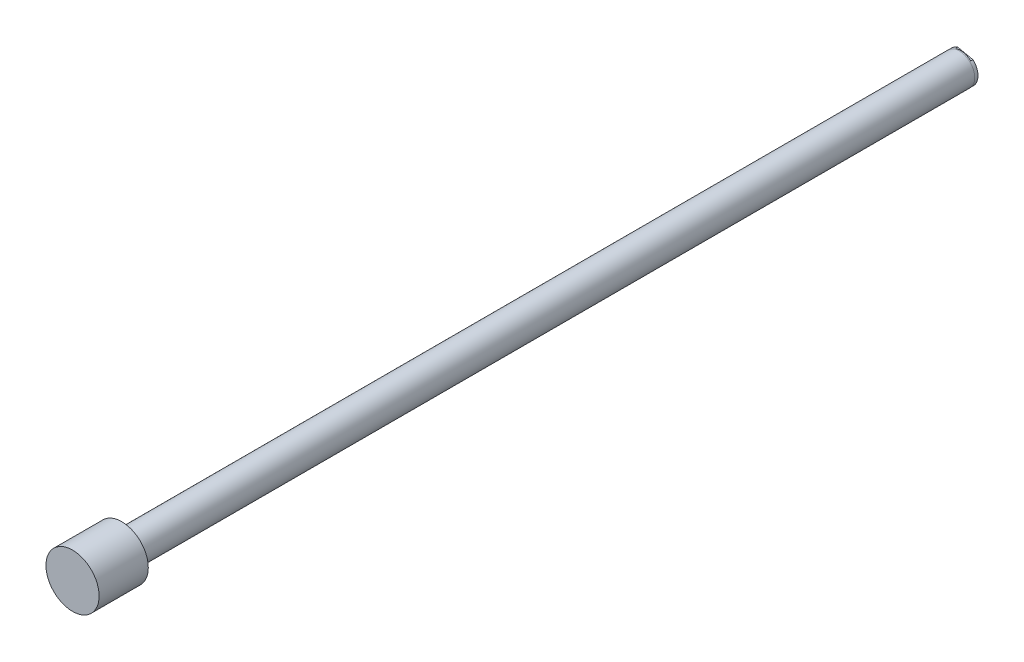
ISO-10303-21;
HEADER;
FILE_DESCRIPTION(('STEP AP214'),'2;1');
FILE_NAME('part.step','',(''),(''),'','','');
FILE_SCHEMA(('AUTOMOTIVE_DESIGN { 1 0 10303 214 1 1 1 1 }'));
ENDSEC;
DATA;
#1=APPLICATION_CONTEXT('core data for automotive mechanical design processes');
#2=APPLICATION_PROTOCOL_DEFINITION('international standard','automotive_design',2000,#1);
#3=PRODUCT_CONTEXT('',#1,'mechanical');
#4=PRODUCT('Part','Part','',(#3));
#5=PRODUCT_RELATED_PRODUCT_CATEGORY('part','',(#4));
#6=PRODUCT_DEFINITION_FORMATION('','',#4);
#7=PRODUCT_DEFINITION_CONTEXT('part definition',#1,'design');
#8=PRODUCT_DEFINITION('design','',#6,#7);
#9=PRODUCT_DEFINITION_SHAPE('','',#8);
#10=(LENGTH_UNIT() NAMED_UNIT(*) SI_UNIT(.MILLI.,.METRE.));
#11=(NAMED_UNIT(*) PLANE_ANGLE_UNIT() SI_UNIT($,.RADIAN.));
#12=(NAMED_UNIT(*) SI_UNIT($,.STERADIAN.) SOLID_ANGLE_UNIT());
#13=UNCERTAINTY_MEASURE_WITH_UNIT(LENGTH_MEASURE(1.E-05),#10,'distance_accuracy_value','');
#14=(GEOMETRIC_REPRESENTATION_CONTEXT(3) GLOBAL_UNCERTAINTY_ASSIGNED_CONTEXT((#13)) GLOBAL_UNIT_ASSIGNED_CONTEXT((#10,
#11,#12)) REPRESENTATION_CONTEXT('',''));
#15=CARTESIAN_POINT('',(0.,0.,0.));
#16=DIRECTION('',(0.,0.,1.));
#17=DIRECTION('',(1.,0.,0.));
#18=AXIS2_PLACEMENT_3D('',#15,#16,#17);
#19=CARTESIAN_POINT('',(0.,0.,35.56));
#20=DIRECTION('',(0.,0.,1.));
#21=DIRECTION('',(1.,0.,0.));
#22=AXIS2_PLACEMENT_3D('',#19,#20,#21);
#23=PLANE('',#22);
#24=CARTESIAN_POINT('',(0.,0.,35.56));
#25=DIRECTION('',(0.,0.,1.));
#26=DIRECTION('',(1.,0.,0.));
#27=AXIS2_PLACEMENT_3D('',#24,#25,#26);
#28=CIRCLE('',#27,38.1);
#29=CARTESIAN_POINT('',(38.1,0.,35.56));
#30=VERTEX_POINT('',#29);
#31=EDGE_CURVE('E109',#30,#30,#28,.T.);
#32=ORIENTED_EDGE('',*,*,#31,.T.);
#33=EDGE_LOOP('',(#32));
#34=FACE_BOUND('',#33,.T.);
#35=ADVANCED_FACE('F16',(#34),#23,.T.);
#36=CARTESIAN_POINT('',(0.,0.,-34.925));
#37=DIRECTION('',(0.,0.,1.));
#38=DIRECTION('',(1.,0.,0.));
#39=AXIS2_PLACEMENT_3D('',#36,#37,#38);
#40=CYLINDRICAL_SURFACE('',#39,38.1);
#41=ORIENTED_EDGE('',*,*,#31,.F.);
#42=EDGE_LOOP('',(#41));
#43=FACE_BOUND('',#42,.T.);
#44=CARTESIAN_POINT('',(0.,0.,-34.92754));
#45=DIRECTION('',(0.,0.,-1.));
#46=DIRECTION('',(-1.,0.,0.));
#47=AXIS2_PLACEMENT_3D('',#44,#45,#46);
#48=CIRCLE('',#47,38.1);
#49=CARTESIAN_POINT('',(-38.1,0.,-34.92754));
#50=VERTEX_POINT('',#49);
#51=EDGE_CURVE('E101',#50,#50,#48,.T.);
#52=ORIENTED_EDGE('',*,*,#51,.F.);
#53=EDGE_LOOP('',(#52));
#54=FACE_BOUND('',#53,.T.);
#55=ADVANCED_FACE('F156',(#43,#54),#40,.T.);
#56=CARTESIAN_POINT('',(0.,0.,-34.92754));
#57=DIRECTION('',(0.,0.,-1.));
#58=DIRECTION('',(-1.,0.,0.));
#59=AXIS2_PLACEMENT_3D('',#56,#57,#58);
#60=PLANE('',#59);
#61=CARTESIAN_POINT('',(0.,0.,-34.92754));
#62=DIRECTION('',(0.,0.,-1.));
#63=DIRECTION('',(-1.,0.,0.));
#64=AXIS2_PLACEMENT_3D('',#61,#62,#63);
#65=CIRCLE('',#64,22.225);
#66=CARTESIAN_POINT('',(-22.225,0.,-34.92754));
#67=VERTEX_POINT('',#66);
#68=EDGE_CURVE('E104',#67,#67,#65,.T.);
#69=ORIENTED_EDGE('',*,*,#68,.F.);
#70=EDGE_LOOP('',(#69));
#71=FACE_BOUND('',#70,.T.);
#72=ORIENTED_EDGE('',*,*,#51,.T.);
#73=EDGE_LOOP('',(#72));
#74=FACE_BOUND('',#73,.T.);
#75=ADVANCED_FACE('F153',(#71,#74),#60,.T.);
#76=CARTESIAN_POINT('',(0.,0.,-1235.329));
#77=DIRECTION('',(0.,0.,1.));
#78=DIRECTION('',(1.,0.,0.));
#79=AXIS2_PLACEMENT_3D('',#76,#77,#78);
#80=CYLINDRICAL_SURFACE('',#79,22.225);
#81=ORIENTED_EDGE('',*,*,#68,.T.);
#82=EDGE_LOOP('',(#81));
#83=FACE_BOUND('',#82,.T.);
#84=CARTESIAN_POINT('',(0.,0.,-1235.329));
#85=DIRECTION('',(0.,0.,-1.));
#86=DIRECTION('',(-1.,0.,0.));
#87=AXIS2_PLACEMENT_3D('',#84,#85,#86);
#88=CIRCLE('',#87,22.225);
#89=CARTESIAN_POINT('',(-22.2250000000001,0.,-1235.329));
#90=VERTEX_POINT('',#89);
#91=EDGE_CURVE('E25',#90,#90,#88,.T.);
#92=ORIENTED_EDGE('',*,*,#91,.F.);
#93=EDGE_LOOP('',(#92));
#94=FACE_BOUND('',#93,.T.);
#95=ADVANCED_FACE('F143',(#83,#94),#80,.T.);
#96=CARTESIAN_POINT('',(0.,0.,-1235.329));
#97=DIRECTION('',(0.,0.,-1.));
#98=DIRECTION('',(-1.,0.,0.));
#99=AXIS2_PLACEMENT_3D('',#96,#97,#98);
#100=PLANE('',#99);
#101=CARTESIAN_POINT('',(0.,0.,-1235.329));
#102=DIRECTION('',(0.,0.,-1.));
#103=DIRECTION('',(-1.,0.,0.));
#104=AXIS2_PLACEMENT_3D('',#101,#102,#103);
#105=CIRCLE('',#104,22.098);
#106=CARTESIAN_POINT('',(-22.098,0.,-1235.329));
#107=VERTEX_POINT('',#106);
#108=EDGE_CURVE('E10',#107,#107,#105,.T.);
#109=ORIENTED_EDGE('',*,*,#108,.F.);
#110=EDGE_LOOP('',(#109));
#111=FACE_BOUND('',#110,.T.);
#112=ORIENTED_EDGE('',*,*,#91,.T.);
#113=EDGE_LOOP('',(#112));
#114=FACE_BOUND('',#113,.T.);
#115=ADVANCED_FACE('F134',(#111,#114),#100,.T.);
#116=CARTESIAN_POINT('',(0.,0.,-1197.2465));
#117=DIRECTION('',(0.,0.,-1.));
#118=DIRECTION('',(-0.978147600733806,0.20791169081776,0.));
#119=AXIS2_PLACEMENT_3D('',#116,#117,#118);
#120=CONICAL_SURFACE('',#119,8.73125,1.02974425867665);
#121=CARTESIAN_POINT('',(0.,0.,-1192.00023572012));
#122=VERTEX_POINT('',#121);
#123=VERTEX_LOOP('',#122);
#124=FACE_BOUND('',#123,.T.);
#125=CARTESIAN_POINT('',(0.,0.,-1197.2465));
#126=DIRECTION('',(0.,0.,-1.));
#127=DIRECTION('',(-0.978147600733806,0.20791169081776,0.));
#128=AXIS2_PLACEMENT_3D('',#125,#126,#127);
#129=CIRCLE('',#128,8.73125);
#130=CARTESIAN_POINT('',(-8.54045123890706,1.81532895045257,-1197.2465));
#131=VERTEX_POINT('',#130);
#132=EDGE_CURVE('E92',#131,#131,#129,.T.);
#133=ORIENTED_EDGE('',*,*,#132,.T.);
#134=EDGE_LOOP('',(#133));
#135=FACE_BOUND('',#134,.T.);
#136=ADVANCED_FACE('F131',(#124,#135),#120,.F.);
#137=CARTESIAN_POINT('',(0.,0.,-1240.109));
#138=DIRECTION('',(0.,0.,-1.));
#139=DIRECTION('',(-0.978147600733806,0.20791169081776,0.));
#140=AXIS2_PLACEMENT_3D('',#137,#138,#139);
#141=CYLINDRICAL_SURFACE('',#140,8.73125);
#142=ORIENTED_EDGE('',*,*,#132,.F.);
#143=EDGE_LOOP('',(#142));
#144=FACE_BOUND('',#143,.T.);
#145=CARTESIAN_POINT('',(0.,0.,-1240.109));
#146=DIRECTION('',(0.,0.,-1.));
#147=DIRECTION('',(-0.978147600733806,0.20791169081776,0.));
#148=AXIS2_PLACEMENT_3D('',#145,#146,#147);
#149=CIRCLE('',#148,8.73125);
#150=CARTESIAN_POINT('',(-8.54045123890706,1.81532895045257,-1240.109));
#151=VERTEX_POINT('',#150);
#152=EDGE_CURVE('E95',#151,#151,#149,.T.);
#153=ORIENTED_EDGE('',*,*,#152,.T.);
#154=EDGE_LOOP('',(#153));
#155=FACE_BOUND('',#154,.T.);
#156=ADVANCED_FACE('F133',(#144,#155),#141,.F.);
#157=CARTESIAN_POINT('',(0.,0.,-1236.934));
#158=DIRECTION('',(0.,0.,-1.));
#159=DIRECTION('',(-0.978147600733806,0.20791169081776,0.));
#160=AXIS2_PLACEMENT_3D('',#157,#158,#159);
#161=PLANE('',#160);
#162=CARTESIAN_POINT('',(0.,0.,-1236.934));
#163=DIRECTION('',(0.,0.,-1.));
#164=DIRECTION('',(-0.978147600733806,0.20791169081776,0.));
#165=AXIS2_PLACEMENT_3D('',#162,#163,#164);
#166=CIRCLE('',#165,22.098);
#167=CARTESIAN_POINT('',(6.99362290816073,-20.9621287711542,-1236.934));
#168=VERTEX_POINT('',#167);
#169=CARTESIAN_POINT('',(-14.9150583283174,-16.3052948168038,-1236.934));
#170=VERTEX_POINT('',#169);
#171=EDGE_CURVE('E65',#168,#170,#166,.T.);
#172=ORIENTED_EDGE('',*,*,#171,.T.);
#173=DIRECTION('',(0.978147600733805,-0.20791169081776,0.));
#174=VECTOR('',#173,1.);
#175=CARTESIAN_POINT('',(6.99362290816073,-20.9621287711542,-1236.934));
#176=LINE('',#175,#174);
#177=EDGE_CURVE('E67',#170,#168,#176,.T.);
#178=ORIENTED_EDGE('',*,*,#177,.T.);
#179=EDGE_LOOP('',(#172,#178));
#180=FACE_BOUND('',#179,.T.);
#181=ADVANCED_FACE('F66',(#180),#161,.T.);
#182=CARTESIAN_POINT('',(0.,0.,-1236.934));
#183=DIRECTION('',(0.,0.,-1.));
#184=DIRECTION('',(-0.978147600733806,0.20791169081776,0.));
#185=AXIS2_PLACEMENT_3D('',#182,#183,#184);
#186=PLANE('',#185);
#187=CARTESIAN_POINT('',(0.,0.,-1236.934));
#188=DIRECTION('',(0.,0.,-1.));
#189=DIRECTION('',(-0.978147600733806,0.20791169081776,0.));
#190=AXIS2_PLACEMENT_3D('',#187,#188,#189);
#191=CIRCLE('',#190,22.098);
#192=CARTESIAN_POINT('',(-6.99362290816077,20.9621287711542,-1236.934));
#193=VERTEX_POINT('',#192);
#194=CARTESIAN_POINT('',(14.9150583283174,16.3052948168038,-1236.934));
#195=VERTEX_POINT('',#194);
#196=EDGE_CURVE('E84',#193,#195,#191,.T.);
#197=ORIENTED_EDGE('',*,*,#196,.T.);
#198=DIRECTION('',(-0.978147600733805,0.20791169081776,0.));
#199=VECTOR('',#198,1.);
#200=CARTESIAN_POINT('',(14.9150583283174,16.3052948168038,-1236.934));
#201=LINE('',#200,#199);
#202=EDGE_CURVE('E86',#195,#193,#201,.T.);
#203=ORIENTED_EDGE('',*,*,#202,.T.);
#204=EDGE_LOOP('',(#197,#203));
#205=FACE_BOUND('',#204,.T.);
#206=ADVANCED_FACE('F117',(#205),#186,.T.);
#207=CARTESIAN_POINT('',(14.9150583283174,16.3052948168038,-1236.934));
#208=DIRECTION('',(-0.20791169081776,-0.978147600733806,0.));
#209=DIRECTION('',(0.,0.,-1.));
#210=AXIS2_PLACEMENT_3D('',#207,#208,#209);
#211=PLANE('',#210);
#212=DIRECTION('',(-0.978147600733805,0.20791169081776,0.));
#213=VECTOR('',#212,1.);
#214=CARTESIAN_POINT('',(14.9150583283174,16.3052948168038,-1240.109));
#215=LINE('',#214,#213);
#216=CARTESIAN_POINT('',(14.9150583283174,16.3052948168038,-1240.109));
#217=VERTEX_POINT('',#216);
#218=CARTESIAN_POINT('',(-6.99362290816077,20.9621287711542,-1240.109));
#219=VERTEX_POINT('',#218);
#220=EDGE_CURVE('E80',#217,#219,#215,.T.);
#221=ORIENTED_EDGE('',*,*,#220,.T.);
#222=DIRECTION('',(0.,0.,-1.));
#223=VECTOR('',#222,1.);
#224=CARTESIAN_POINT('',(-6.99362290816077,20.9621287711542,-1236.934));
#225=LINE('',#224,#223);
#226=EDGE_CURVE('E90',#193,#219,#225,.T.);
#227=ORIENTED_EDGE('',*,*,#226,.F.);
#228=ORIENTED_EDGE('',*,*,#202,.F.);
#229=DIRECTION('',(0.,0.,-1.));
#230=VECTOR('',#229,1.);
#231=CARTESIAN_POINT('',(14.9150583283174,16.3052948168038,-1236.934));
#232=LINE('',#231,#230);
#233=EDGE_CURVE('E41',#195,#217,#232,.T.);
#234=ORIENTED_EDGE('',*,*,#233,.T.);
#235=EDGE_LOOP('',(#221,#227,#228,#234));
#236=FACE_BOUND('',#235,.T.);
#237=ADVANCED_FACE('F118',(#236),#211,.F.);
#238=CARTESIAN_POINT('',(0.,0.,-1240.109));
#239=DIRECTION('',(0.,0.,-1.));
#240=DIRECTION('',(-0.978147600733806,0.20791169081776,0.));
#241=AXIS2_PLACEMENT_3D('',#238,#239,#240);
#242=PLANE('',#241);
#243=DIRECTION('',(0.978147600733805,-0.20791169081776,0.));
#244=VECTOR('',#243,1.);
#245=CARTESIAN_POINT('',(6.99362290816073,-20.9621287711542,-1240.109));
#246=LINE('',#245,#244);
#247=CARTESIAN_POINT('',(-14.9150583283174,-16.3052948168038,-1240.109));
#248=VERTEX_POINT('',#247);
#249=CARTESIAN_POINT('',(6.99362290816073,-20.9621287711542,-1240.109));
#250=VERTEX_POINT('',#249);
#251=EDGE_CURVE('E70',#248,#250,#246,.T.);
#252=ORIENTED_EDGE('',*,*,#251,.F.);
#253=CARTESIAN_POINT('',(0.,0.,-1240.109));
#254=DIRECTION('',(0.,0.,-1.));
#255=DIRECTION('',(-0.978147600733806,0.20791169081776,0.));
#256=AXIS2_PLACEMENT_3D('',#253,#254,#255);
#257=CIRCLE('',#256,22.098);
#258=EDGE_CURVE('E78',#248,#219,#257,.T.);
#259=ORIENTED_EDGE('',*,*,#258,.T.);
#260=ORIENTED_EDGE('',*,*,#220,.F.);
#261=EDGE_CURVE('E20',#217,#250,#257,.T.);
#262=ORIENTED_EDGE('',*,*,#261,.T.);
#263=EDGE_LOOP('',(#252,#259,#260,#262));
#264=FACE_BOUND('',#263,.T.);
#265=ORIENTED_EDGE('',*,*,#152,.F.);
#266=EDGE_LOOP('',(#265));
#267=FACE_BOUND('',#266,.T.);
#268=ADVANCED_FACE('F119',(#264,#267),#242,.T.);
#269=CARTESIAN_POINT('',(6.99362290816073,-20.9621287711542,-1236.934));
#270=DIRECTION('',(0.20791169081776,0.978147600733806,0.));
#271=DIRECTION('',(0.,0.,1.));
#272=AXIS2_PLACEMENT_3D('',#269,#270,#271);
#273=PLANE('',#272);
#274=ORIENTED_EDGE('',*,*,#251,.T.);
#275=DIRECTION('',(0.,0.,-1.));
#276=VECTOR('',#275,1.);
#277=CARTESIAN_POINT('',(6.99362290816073,-20.9621287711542,-1236.934));
#278=LINE('',#277,#276);
#279=EDGE_CURVE('E73',#168,#250,#278,.T.);
#280=ORIENTED_EDGE('',*,*,#279,.F.);
#281=ORIENTED_EDGE('',*,*,#177,.F.);
#282=DIRECTION('',(0.,0.,-1.));
#283=VECTOR('',#282,1.);
#284=CARTESIAN_POINT('',(-14.9150583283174,-16.3052948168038,-1236.934));
#285=LINE('',#284,#283);
#286=EDGE_CURVE('E33',#170,#248,#285,.T.);
#287=ORIENTED_EDGE('',*,*,#286,.T.);
#288=EDGE_LOOP('',(#274,#280,#281,#287));
#289=FACE_BOUND('',#288,.T.);
#290=ADVANCED_FACE('F72',(#289),#273,.F.);
#291=CARTESIAN_POINT('',(0.,0.,-1242.44478792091));
#292=DIRECTION('',(0.,0.,-1.));
#293=DIRECTION('',(-0.978147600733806,0.20791169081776,0.));
#294=AXIS2_PLACEMENT_3D('',#291,#292,#293);
#295=CYLINDRICAL_SURFACE('',#294,22.098);
#296=ORIENTED_EDGE('',*,*,#279,.T.);
#297=ORIENTED_EDGE('',*,*,#261,.F.);
#298=ORIENTED_EDGE('',*,*,#233,.F.);
#299=ORIENTED_EDGE('',*,*,#196,.F.);
#300=ORIENTED_EDGE('',*,*,#226,.T.);
#301=ORIENTED_EDGE('',*,*,#258,.F.);
#302=ORIENTED_EDGE('',*,*,#286,.F.);
#303=ORIENTED_EDGE('',*,*,#171,.F.);
#304=EDGE_LOOP('',(#296,#297,#298,#299,#300,#301,#302,#303));
#305=FACE_BOUND('',#304,.T.);
#306=ORIENTED_EDGE('',*,*,#108,.T.);
#307=EDGE_LOOP('',(#306));
#308=FACE_BOUND('',#307,.T.);
#309=ADVANCED_FACE('F18',(#305,#308),#295,.T.);
#310=CLOSED_SHELL('',(#35,#55,#75,#95,#115,#136,#156,#181,#206,#237,#268,#290,#309));
#311=MANIFOLD_SOLID_BREP('B1',#310);
#312=ADVANCED_BREP_SHAPE_REPRESENTATION('',(#18,#311),#14);
#313=SHAPE_DEFINITION_REPRESENTATION(#9,#312);
ENDSEC;
END-ISO-10303-21;
